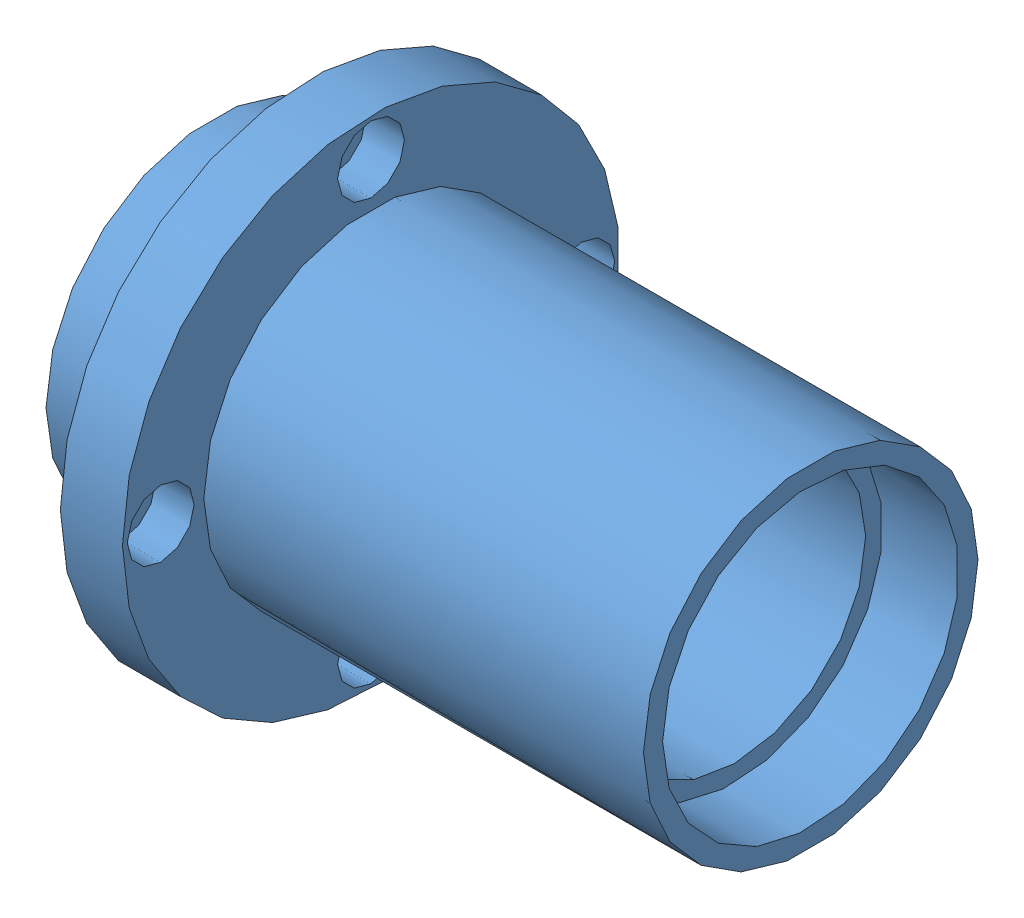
SolidWorks assembly BGFRL6206DD-125-S20.sldasm, configuration Default (file format 5000). Lengths in mm.
Overall size (125 104 104).
3 component instances, 2 part files, 0 mates.
Components (placement in the parent):
- housing_BGFRLB6206-125-S20-1: housing_BGFRLB6206-125-S20.sldprt [Default] at origin size (125 104 104)
- bearingB6206ZZ-1: bearingB6206ZZ.sldprt [Default] at origin (suppressed, hidden)
- bearingB6206ZZ-2: bearingB6206ZZ.sldprt [Default] at (125 0 0) x (-1 0 0) z (0 0 1) (suppressed, hidden)
